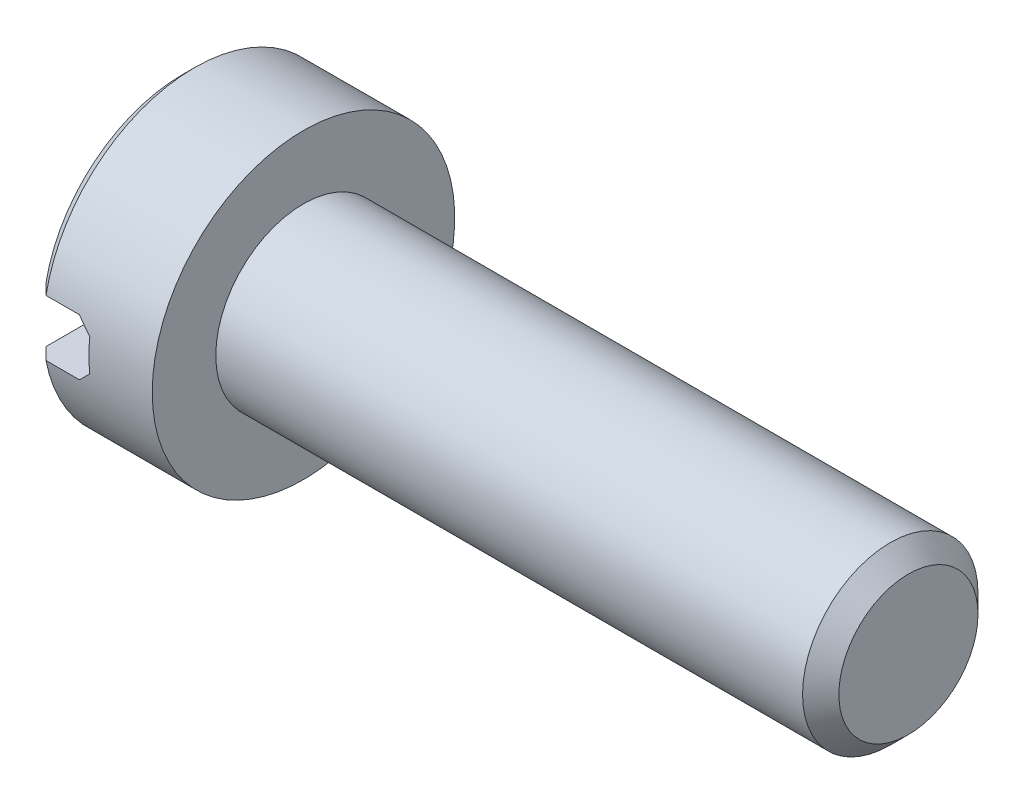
from build123d import *

# Parameters (mm, degrees)
ENL_V_MAT_EXTRU_1_DEPTH = 5
ESQUISSE3_R             = 1.45
EXTRUSION1_DEPTH        = 10
CHANFREIN1_SIZE         = 0.3


with BuildPart() as part:
    # Esquisse1 → R_volution1 (revolve)
    with BuildSketch(Plane.XY, mode=Mode.PRIVATE) as r_volution1_sk:
        Polygon((0, 0), (0, 2.3), (0.2, 2.5), (2, 2.5), (2, 0), align=None)
    revolve(r_volution1_sk.sketch.rotate(Axis((0, 0, 0), (1, 0, 0)), 90), axis=Axis((0, 0, 0), (1, 0, 0)))

    # Esquisse2 → Enl_v. mat.-Extru.1 (cut, symmetric)
    with BuildSketch(Plane.XY):
        Polygon((0, 0.465549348), (0.753445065, 0.465549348), (0.953445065, 0.265549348), (0.953445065, -0.265549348), (0.753445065, -0.465549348), (0, -0.465549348), align=None)
    extrude(amount=ENL_V_MAT_EXTRU_1_DEPTH, both=True, mode=Mode.SUBTRACT)

    # Esquisse3 → Extrusion1 (add)
    with BuildSketch(Plane(origin=(2, 0, 0), x_dir=(0, 0, -1), z_dir=(1, 0, 0))):
        with Locations(Location((0, 0, 0), (0, 0, 180))):
            Circle(ESQUISSE3_R)
    extrude(amount=EXTRUSION1_DEPTH)

    # Chanfrein1
    chanfrein1_edges = [part.edges().sort_by_distance(p)[0] for p in [
        (12, 0, -1.45),
    ]]
    chamfer(chanfrein1_edges, length=CHANFREIN1_SIZE)


solid = part.part
